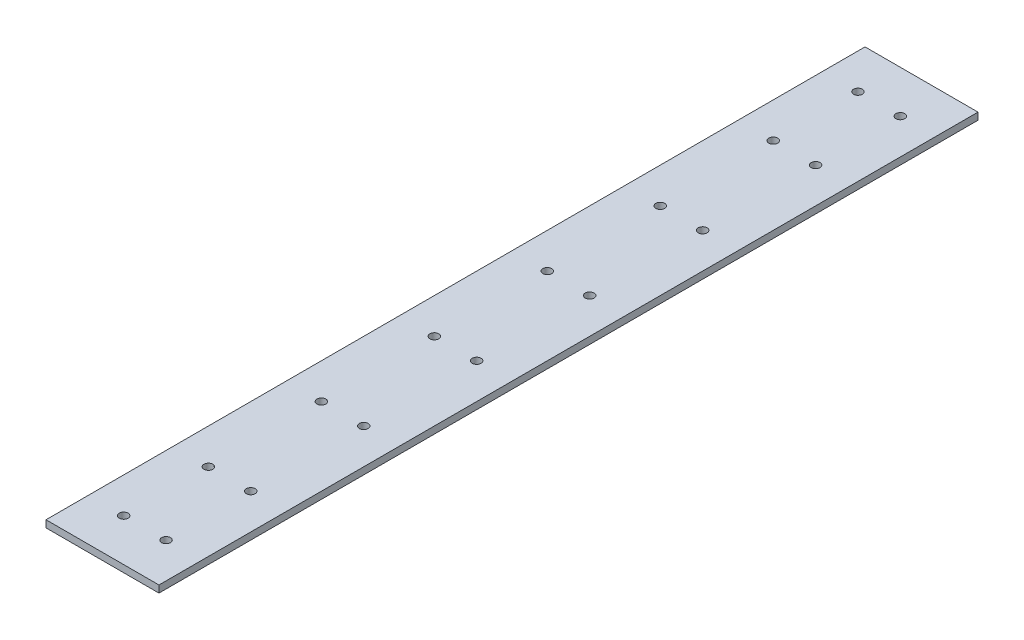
from build123d import *

# Parameters (mm, degrees)
SKETCH1_W      = 101.6
SKETCH1_H      = 6.35
EXTRUDE1_DEPTH = 736.6
SKETCH2_R      = 3.9751
EXTRUDE2_DEPTH = 6.35


with BuildPart() as part:
    # Sketch1 → Extrude1 (new body)
    with BuildSketch(Plane.XY):
        Rectangle(SKETCH1_W, SKETCH1_H)
    extrude(amount=EXTRUDE1_DEPTH)

    # Sketch2 → Extrude2 (cut)
    with BuildSketch(Plane(origin=(0, 3.175, 0), x_dir=(1, 0, 0), z_dir=(0, 1, 0))):
        with Locations(Location((-19.05, -38.1, 0), (0, 0, 180))):
            Circle(SKETCH2_R)
        with Locations(Location((19.05, -38.1, 0), (0, 0, 180))):
            Circle(SKETCH2_R)
        with Locations(Location((19.05, -114.3, 0), (0, 0, 180))):
            Circle(SKETCH2_R)
        with Locations(Location((19.05, -215.9, 0), (0, 0, 180))):
            Circle(SKETCH2_R)
        with Locations(Location((19.05, -317.5, 0), (0, 0, 180))):
            Circle(SKETCH2_R)
        with Locations(Location((19.05, -419.1, 0), (0, 0, 180))):
            Circle(SKETCH2_R)
        with Locations(Location((19.05, -520.7, 0), (0, 0, 180))):
            Circle(SKETCH2_R)
        with Locations(Location((19.05, -622.3, 0), (0, 0, 180))):
            Circle(SKETCH2_R)
        with Locations(Location((19.05, -698.5, 0), (0, 0, 180))):
            Circle(SKETCH2_R)
        with Locations(Location((-19.05, -698.5, 0), (0, 0, 180))):
            Circle(SKETCH2_R)
        with Locations(Location((-19.05, -622.3, 0), (0, 0, 180))):
            Circle(SKETCH2_R)
        with Locations(Location((-19.05, -520.7, 0), (0, 0, 180))):
            Circle(SKETCH2_R)
        with Locations(Location((-19.05, -419.1, 0), (0, 0, 180))):
            Circle(SKETCH2_R)
        with Locations(Location((-19.05, -317.5, 0), (0, 0, 180))):
            Circle(SKETCH2_R)
        with Locations(Location((-19.05, -215.9, 0), (0, 0, 180))):
            Circle(SKETCH2_R)
        with Locations(Location((-19.05, -114.3, 0), (0, 0, 180))):
            Circle(SKETCH2_R)
    extrude(amount=-EXTRUDE2_DEPTH, mode=Mode.SUBTRACT)


solid = part.part
